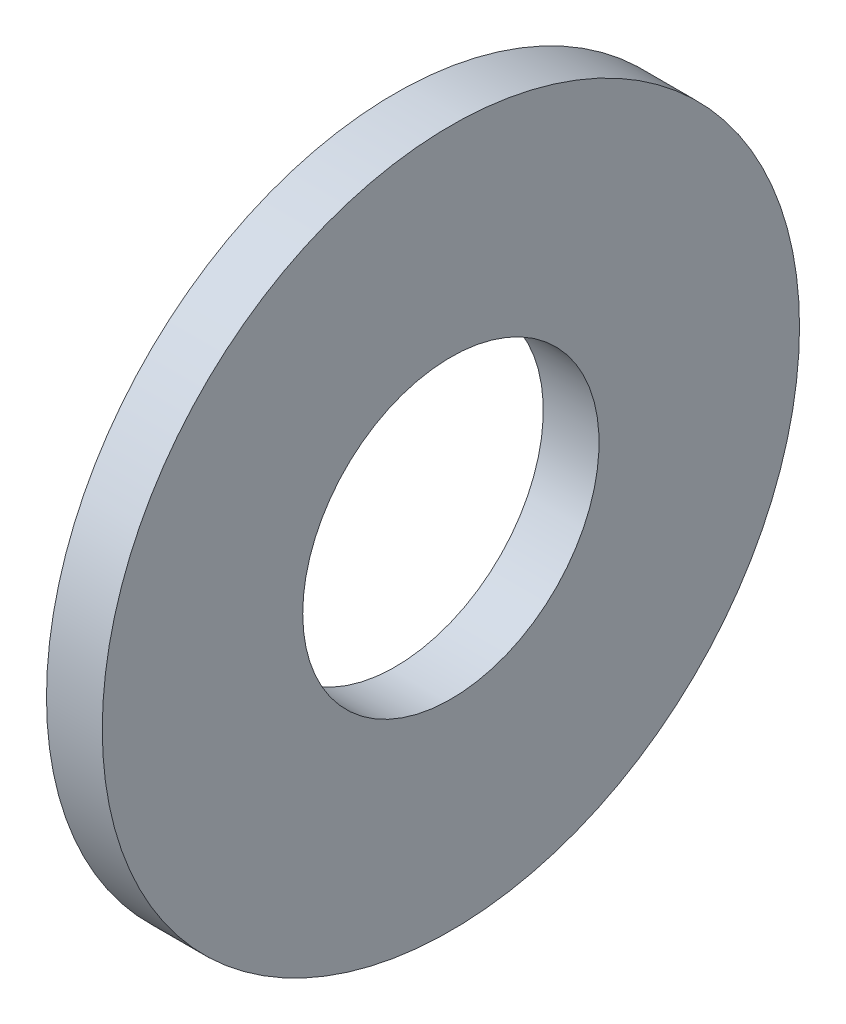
ISO-10303-21;
HEADER;
FILE_DESCRIPTION(('STEP AP214'),'2;1');
FILE_NAME('part.step','',(''),(''),'','','');
FILE_SCHEMA(('AUTOMOTIVE_DESIGN { 1 0 10303 214 1 1 1 1 }'));
ENDSEC;
DATA;
#1=APPLICATION_CONTEXT('core data for automotive mechanical design processes');
#2=APPLICATION_PROTOCOL_DEFINITION('international standard','automotive_design',2000,#1);
#3=PRODUCT_CONTEXT('',#1,'mechanical');
#4=PRODUCT('Part','Part','',(#3));
#5=PRODUCT_RELATED_PRODUCT_CATEGORY('part','',(#4));
#6=PRODUCT_DEFINITION_FORMATION('','',#4);
#7=PRODUCT_DEFINITION_CONTEXT('part definition',#1,'design');
#8=PRODUCT_DEFINITION('design','',#6,#7);
#9=PRODUCT_DEFINITION_SHAPE('','',#8);
#10=(LENGTH_UNIT() NAMED_UNIT(*) SI_UNIT(.MILLI.,.METRE.));
#11=(NAMED_UNIT(*) PLANE_ANGLE_UNIT() SI_UNIT($,.RADIAN.));
#12=(NAMED_UNIT(*) SI_UNIT($,.STERADIAN.) SOLID_ANGLE_UNIT());
#13=UNCERTAINTY_MEASURE_WITH_UNIT(LENGTH_MEASURE(1.E-05),#10,'distance_accuracy_value','');
#14=(GEOMETRIC_REPRESENTATION_CONTEXT(3) GLOBAL_UNCERTAINTY_ASSIGNED_CONTEXT((#13)) GLOBAL_UNIT_ASSIGNED_CONTEXT((#10,
#11,#12)) REPRESENTATION_CONTEXT('',''));
#15=CARTESIAN_POINT('',(0.,0.,0.));
#16=DIRECTION('',(0.,0.,1.));
#17=DIRECTION('',(1.,0.,0.));
#18=AXIS2_PLACEMENT_3D('',#15,#16,#17);
#19=CARTESIAN_POINT('',(-34.9249999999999,0.,0.));
#20=DIRECTION('',(-1.,0.,0.));
#21=DIRECTION('',(0.,0.,1.));
#22=AXIS2_PLACEMENT_3D('',#19,#20,#21);
#23=CYLINDRICAL_SURFACE('',#22,2.125);
#24=CARTESIAN_POINT('',(0.,0.,0.));
#25=DIRECTION('',(-1.,0.,0.));
#26=DIRECTION('',(0.,0.,1.));
#27=AXIS2_PLACEMENT_3D('',#24,#25,#26);
#28=CIRCLE('',#27,2.125);
#29=CARTESIAN_POINT('',(0.,0.,2.125));
#30=VERTEX_POINT('',#29);
#31=EDGE_CURVE('E10',#30,#30,#28,.T.);
#32=ORIENTED_EDGE('',*,*,#31,.F.);
#33=EDGE_LOOP('',(#32));
#34=FACE_BOUND('',#33,.T.);
#35=CARTESIAN_POINT('',(-0.800000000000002,0.,0.));
#36=DIRECTION('',(-1.,0.,0.));
#37=DIRECTION('',(0.,0.,1.));
#38=AXIS2_PLACEMENT_3D('',#35,#36,#37);
#39=CIRCLE('',#38,2.125);
#40=CARTESIAN_POINT('',(-0.800000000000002,0.,2.125));
#41=VERTEX_POINT('',#40);
#42=EDGE_CURVE('E44',#41,#41,#39,.T.);
#43=ORIENTED_EDGE('',*,*,#42,.T.);
#44=EDGE_LOOP('',(#43));
#45=FACE_BOUND('',#44,.T.);
#46=ADVANCED_FACE('F30',(#34,#45),#23,.F.);
#47=CARTESIAN_POINT('',(0.,2.125,0.));
#48=DIRECTION('',(-1.,0.,0.));
#49=DIRECTION('',(0.,0.,1.));
#50=AXIS2_PLACEMENT_3D('',#47,#48,#49);
#51=PLANE('',#50);
#52=CARTESIAN_POINT('',(0.,0.,0.));
#53=DIRECTION('',(-1.,0.,0.));
#54=DIRECTION('',(0.,0.,1.));
#55=AXIS2_PLACEMENT_3D('',#52,#53,#54);
#56=CIRCLE('',#55,5.);
#57=CARTESIAN_POINT('',(0.,0.,5.));
#58=VERTEX_POINT('',#57);
#59=EDGE_CURVE('E36',#58,#58,#56,.T.);
#60=ORIENTED_EDGE('',*,*,#59,.F.);
#61=EDGE_LOOP('',(#60));
#62=FACE_BOUND('',#61,.T.);
#63=ORIENTED_EDGE('',*,*,#31,.T.);
#64=EDGE_LOOP('',(#63));
#65=FACE_BOUND('',#64,.T.);
#66=ADVANCED_FACE('F59',(#62,#65),#51,.F.);
#67=CARTESIAN_POINT('',(-34.9249999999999,0.,0.));
#68=DIRECTION('',(-1.,0.,0.));
#69=DIRECTION('',(0.,0.,1.));
#70=AXIS2_PLACEMENT_3D('',#67,#68,#69);
#71=CYLINDRICAL_SURFACE('',#70,5.);
#72=CARTESIAN_POINT('',(-0.800000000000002,0.,0.));
#73=DIRECTION('',(-1.,0.,0.));
#74=DIRECTION('',(0.,0.,1.));
#75=AXIS2_PLACEMENT_3D('',#72,#73,#74);
#76=CIRCLE('',#75,5.);
#77=CARTESIAN_POINT('',(-0.800000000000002,0.,5.));
#78=VERTEX_POINT('',#77);
#79=EDGE_CURVE('E40',#78,#78,#76,.T.);
#80=ORIENTED_EDGE('',*,*,#79,.F.);
#81=EDGE_LOOP('',(#80));
#82=FACE_BOUND('',#81,.T.);
#83=ORIENTED_EDGE('',*,*,#59,.T.);
#84=EDGE_LOOP('',(#83));
#85=FACE_BOUND('',#84,.T.);
#86=ADVANCED_FACE('F54',(#82,#85),#71,.T.);
#87=CARTESIAN_POINT('',(-0.800000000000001,5.,0.));
#88=DIRECTION('',(1.,0.,0.));
#89=DIRECTION('',(0.,0.,-1.));
#90=AXIS2_PLACEMENT_3D('',#87,#88,#89);
#91=PLANE('',#90);
#92=ORIENTED_EDGE('',*,*,#42,.F.);
#93=EDGE_LOOP('',(#92));
#94=FACE_BOUND('',#93,.T.);
#95=ORIENTED_EDGE('',*,*,#79,.T.);
#96=EDGE_LOOP('',(#95));
#97=FACE_BOUND('',#96,.T.);
#98=ADVANCED_FACE('F51',(#94,#97),#91,.F.);
#99=CLOSED_SHELL('',(#46,#66,#86,#98));
#100=MANIFOLD_SOLID_BREP('B2',#99);
#101=ADVANCED_BREP_SHAPE_REPRESENTATION('',(#18,#100),#14);
#102=SHAPE_DEFINITION_REPRESENTATION(#9,#101);
ENDSEC;
END-ISO-10303-21;
